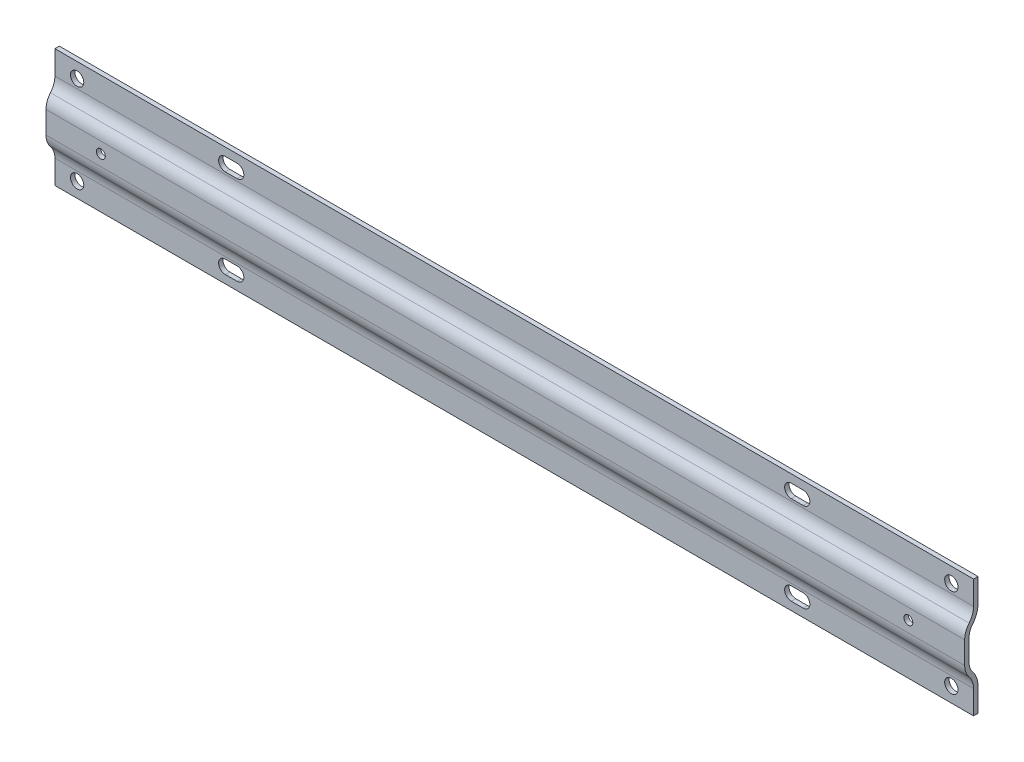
from build123d import *

# Parameters (mm, degrees)
EXTRUDE_1_DEPTH          = 620
CUT_EXTRUDE_1_DEPTH      = 622.31795403
CUT_EXTRUDE_1_DEPTH_BACK = 622.31795403
SKETCH_3_R               = 4.5
SKETCH_3_R_2             = 3


with BuildPart() as part:
    # Sketch 1 → Extrude 1 (new body)
    with BuildSketch(Plane(origin=(0, 0, 0), x_dir=(0, 0, -1), z_dir=(1, 0, 0))):
        with BuildLine():
            Line((9, -40), (9, -24))
            ThreePointArc((9, -24), (8.046102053, -18.585508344), (5.299270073, -13.822992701))
            ThreePointArc((5.299270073, -13.822992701), (3.592658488, -10.864033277), (3, -7.5))
            Line((3, -7.5), (3, 7.5))
            ThreePointArc((3, 7.5), (3.592658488, 10.864033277), (5.299270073, 13.822992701))
            ThreePointArc((5.299270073, 13.822992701), (8.046102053, 18.585508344), (9, 24))
            Line((9, 24), (9, 40))
            Line((9, 40), (6, 40))
            Line((6, 40), (6, 24))
            ThreePointArc((6, 24), (5.226721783, 19.610737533), (3, 15.75))
            ThreePointArc((3, 15.75), (0.773278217, 11.889262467), (0, 7.5))
            Line((0, 7.5), (0, -7.5))
            ThreePointArc((0, -7.5), (0.773278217, -11.889262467), (3, -15.75))
            ThreePointArc((3, -15.75), (5.226721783, -19.610737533), (6, -24))
            Line((6, -24), (6, -40))
            Line((6, -40), (9, -40))
        make_face()
    extrude(amount=-EXTRUDE_1_DEPTH)

    # Sketch 3 → Cut-Extrude 1 (cut, two sides: drawn at the far end of the back side and taken through both)
    with BuildSketch(Plane.XY.offset(-6).offset(-CUT_EXTRUDE_1_DEPTH_BACK)):
        with Locations((-15, 30)):
            Circle(SKETCH_3_R)
        with Locations((-38, 0)):
            Circle(SKETCH_3_R_2)
        with Locations((-583, 0)):
            Circle(SKETCH_3_R_2)
        with Locations((-15, -30)):
            Circle(SKETCH_3_R)
        with Locations((-605, 30)):
            Circle(SKETCH_3_R)
        with Locations((-605, -30)):
            Circle(SKETCH_3_R)
        with BuildLine():
            Line((-123, 34.5), (-115, 34.5))
            ThreePointArc((-115, 34.5), (-110.5, 30), (-115, 25.5))
            Line((-115, 25.5), (-123, 25.5))
            ThreePointArc((-123, 25.5), (-127.5, 30), (-123, 34.5))
        make_face()
        with BuildLine():
            Line((-123, -34.5), (-115, -34.5))
            ThreePointArc((-115, -34.5), (-110.5, -30), (-115, -25.5))
            Line((-115, -25.5), (-123, -25.5))
            ThreePointArc((-123, -25.5), (-127.5, -30), (-123, -34.5))
        make_face()
        with BuildLine():
            Line((-497, 34.5), (-505, 34.5))
            ThreePointArc((-505, 34.5), (-509.5, 30), (-505, 25.5))
            Line((-505, 25.5), (-497, 25.5))
            ThreePointArc((-497, 25.5), (-492.5, 30), (-497, 34.5))
        make_face()
        with BuildLine():
            Line((-497, -34.5), (-505, -34.5))
            ThreePointArc((-505, -34.5), (-509.5, -30), (-505, -25.5))
            Line((-505, -25.5), (-497, -25.5))
            ThreePointArc((-497, -25.5), (-492.5, -30), (-497, -34.5))
        make_face()
    extrude(amount=CUT_EXTRUDE_1_DEPTH + CUT_EXTRUDE_1_DEPTH_BACK, mode=Mode.SUBTRACT)


solid = part.part
